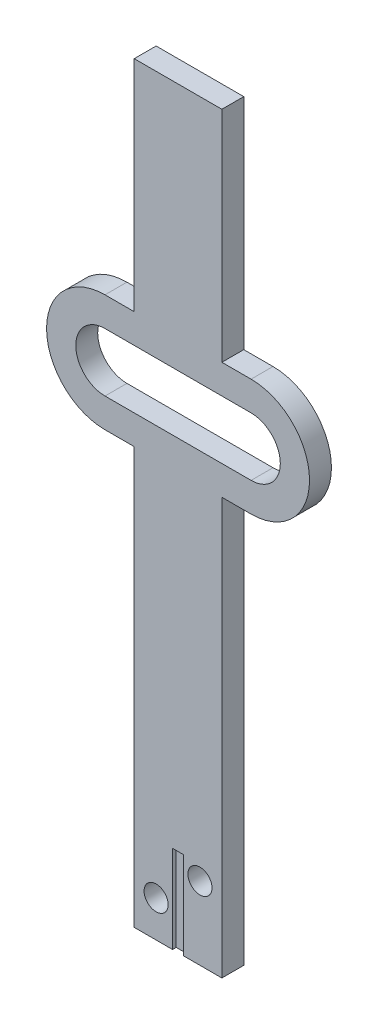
ISO-10303-21;
HEADER;
FILE_DESCRIPTION(('STEP AP214'),'2;1');
FILE_NAME('part.step','',(''),(''),'','','');
FILE_SCHEMA(('AUTOMOTIVE_DESIGN { 1 0 10303 214 1 1 1 1 }'));
ENDSEC;
DATA;
#1=APPLICATION_CONTEXT('core data for automotive mechanical design processes');
#2=APPLICATION_PROTOCOL_DEFINITION('international standard','automotive_design',2000,#1);
#3=PRODUCT_CONTEXT('',#1,'mechanical');
#4=PRODUCT('Part','Part','',(#3));
#5=PRODUCT_RELATED_PRODUCT_CATEGORY('part','',(#4));
#6=PRODUCT_DEFINITION_FORMATION('','',#4);
#7=PRODUCT_DEFINITION_CONTEXT('part definition',#1,'design');
#8=PRODUCT_DEFINITION('design','',#6,#7);
#9=PRODUCT_DEFINITION_SHAPE('','',#8);
#10=(LENGTH_UNIT() NAMED_UNIT(*) SI_UNIT(.MILLI.,.METRE.));
#11=(NAMED_UNIT(*) PLANE_ANGLE_UNIT() SI_UNIT($,.RADIAN.));
#12=(NAMED_UNIT(*) SI_UNIT($,.STERADIAN.) SOLID_ANGLE_UNIT());
#13=UNCERTAINTY_MEASURE_WITH_UNIT(LENGTH_MEASURE(1.E-05),#10,'distance_accuracy_value','');
#14=(GEOMETRIC_REPRESENTATION_CONTEXT(3) GLOBAL_UNCERTAINTY_ASSIGNED_CONTEXT((#13)) GLOBAL_UNIT_ASSIGNED_CONTEXT((#10,
#11,#12)) REPRESENTATION_CONTEXT('',''));
#15=CARTESIAN_POINT('',(0.,0.,0.));
#16=DIRECTION('',(0.,0.,1.));
#17=DIRECTION('',(1.,0.,0.));
#18=AXIS2_PLACEMENT_3D('',#15,#16,#17);
#19=CARTESIAN_POINT('',(-10.,0.,3.));
#20=DIRECTION('',(0.,0.,1.));
#21=DIRECTION('',(1.,0.,0.));
#22=AXIS2_PLACEMENT_3D('',#19,#20,#21);
#23=PLANE('',#22);
#24=CARTESIAN_POINT('',(-3.00000000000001,-60.,3.));
#25=DIRECTION('',(0.,0.,1.));
#26=DIRECTION('',(1.,0.,0.));
#27=AXIS2_PLACEMENT_3D('',#24,#25,#26);
#28=CIRCLE('',#27,1.64999999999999);
#29=CARTESIAN_POINT('',(-1.35000000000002,-60.,3.));
#30=VERTEX_POINT('',#29);
#31=EDGE_CURVE('E587',#30,#30,#28,.T.);
#32=ORIENTED_EDGE('',*,*,#31,.F.);
#33=EDGE_LOOP('',(#32));
#34=FACE_BOUND('',#33,.T.);
#35=CARTESIAN_POINT('',(3.00000000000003,-55.,3.));
#36=DIRECTION('',(0.,0.,1.));
#37=DIRECTION('',(1.,0.,0.));
#38=AXIS2_PLACEMENT_3D('',#35,#36,#37);
#39=CIRCLE('',#38,1.64999999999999);
#40=CARTESIAN_POINT('',(4.65000000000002,-55.,3.));
#41=VERTEX_POINT('',#40);
#42=EDGE_CURVE('E589',#41,#41,#39,.T.);
#43=ORIENTED_EDGE('',*,*,#42,.F.);
#44=EDGE_LOOP('',(#43));
#45=FACE_BOUND('',#44,.T.);
#46=DIRECTION('',(0.,-1.,0.));
#47=VECTOR('',#46,1.);
#48=CARTESIAN_POINT('',(-0.749999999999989,-53.,3.));
#49=LINE('',#48,#47);
#50=CARTESIAN_POINT('',(-0.749999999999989,-53.,3.));
#51=VERTEX_POINT('',#50);
#52=CARTESIAN_POINT('',(-0.749999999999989,-65.,3.));
#53=VERTEX_POINT('',#52);
#54=EDGE_CURVE('E171',#51,#53,#49,.T.);
#55=ORIENTED_EDGE('',*,*,#54,.F.);
#56=DIRECTION('',(-1.,0.,0.));
#57=VECTOR('',#56,1.);
#58=CARTESIAN_POINT('',(-0.749999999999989,-53.,3.));
#59=LINE('',#58,#57);
#60=CARTESIAN_POINT('',(0.750000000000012,-53.,3.));
#61=VERTEX_POINT('',#60);
#62=EDGE_CURVE('E597',#61,#51,#59,.T.);
#63=ORIENTED_EDGE('',*,*,#62,.F.);
#64=DIRECTION('',(0.,1.,0.));
#65=VECTOR('',#64,1.);
#66=CARTESIAN_POINT('',(0.750000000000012,-53.,3.));
#67=LINE('',#66,#65);
#68=CARTESIAN_POINT('',(0.750000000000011,-65.,3.));
#69=VERTEX_POINT('',#68);
#70=EDGE_CURVE('E181',#69,#61,#67,.T.);
#71=ORIENTED_EDGE('',*,*,#70,.F.);
#72=DIRECTION('',(1.,0.,0.));
#73=VECTOR('',#72,1.);
#74=CARTESIAN_POINT('',(-6.00000000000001,-65.,3.));
#75=LINE('',#74,#73);
#76=CARTESIAN_POINT('',(6.00000000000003,-65.,3.));
#77=VERTEX_POINT('',#76);
#78=EDGE_CURVE('E199',#69,#77,#75,.T.);
#79=ORIENTED_EDGE('',*,*,#78,.T.);
#80=DIRECTION('',(0.,1.,0.));
#81=VECTOR('',#80,1.);
#82=CARTESIAN_POINT('',(6.00000000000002,-7.99999999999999,3.));
#83=LINE('',#82,#81);
#84=CARTESIAN_POINT('',(6.00000000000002,-7.99999999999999,3.));
#85=VERTEX_POINT('',#84);
#86=EDGE_CURVE('E198',#77,#85,#83,.T.);
#87=ORIENTED_EDGE('',*,*,#86,.T.);
#88=DIRECTION('',(1.,0.,0.));
#89=VECTOR('',#88,1.);
#90=CARTESIAN_POINT('',(6.00000000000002,-7.99999999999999,3.));
#91=LINE('',#90,#89);
#92=CARTESIAN_POINT('',(10.,-8.00000000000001,3.));
#93=VERTEX_POINT('',#92);
#94=EDGE_CURVE('E201',#85,#93,#91,.T.);
#95=ORIENTED_EDGE('',*,*,#94,.T.);
#96=CARTESIAN_POINT('',(10.,0.,3.));
#97=DIRECTION('',(0.,0.,1.));
#98=DIRECTION('',(1.,0.,0.));
#99=AXIS2_PLACEMENT_3D('',#96,#97,#98);
#100=CIRCLE('',#99,8.);
#101=CARTESIAN_POINT('',(10.,8.,3.));
#102=VERTEX_POINT('',#101);
#103=EDGE_CURVE('E207',#93,#102,#100,.T.);
#104=ORIENTED_EDGE('',*,*,#103,.T.);
#105=DIRECTION('',(-1.,0.,0.));
#106=VECTOR('',#105,1.);
#107=CARTESIAN_POINT('',(5.99999999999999,8.,3.));
#108=LINE('',#107,#106);
#109=CARTESIAN_POINT('',(5.99999999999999,8.,3.));
#110=VERTEX_POINT('',#109);
#111=EDGE_CURVE('E209',#102,#110,#108,.T.);
#112=ORIENTED_EDGE('',*,*,#111,.T.);
#113=DIRECTION('',(0.,1.,0.));
#114=VECTOR('',#113,1.);
#115=CARTESIAN_POINT('',(5.99999999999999,38.,3.));
#116=LINE('',#115,#114);
#117=CARTESIAN_POINT('',(5.99999999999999,38.,3.));
#118=VERTEX_POINT('',#117);
#119=EDGE_CURVE('E211',#110,#118,#116,.T.);
#120=ORIENTED_EDGE('',*,*,#119,.T.);
#121=DIRECTION('',(-1.,0.,0.));
#122=VECTOR('',#121,1.);
#123=CARTESIAN_POINT('',(-6.00000000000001,38.,3.));
#124=LINE('',#123,#122);
#125=CARTESIAN_POINT('',(-6.00000000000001,38.,3.));
#126=VERTEX_POINT('',#125);
#127=EDGE_CURVE('E213',#118,#126,#124,.T.);
#128=ORIENTED_EDGE('',*,*,#127,.T.);
#129=DIRECTION('',(0.,-1.,0.));
#130=VECTOR('',#129,1.);
#131=CARTESIAN_POINT('',(-6.00000000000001,38.,3.));
#132=LINE('',#131,#130);
#133=CARTESIAN_POINT('',(-5.99999999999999,8.,3.));
#134=VERTEX_POINT('',#133);
#135=EDGE_CURVE('E283',#126,#134,#132,.T.);
#136=ORIENTED_EDGE('',*,*,#135,.T.);
#137=DIRECTION('',(-1.,0.,0.));
#138=VECTOR('',#137,1.);
#139=CARTESIAN_POINT('',(-10.,8.,3.));
#140=LINE('',#139,#138);
#141=CARTESIAN_POINT('',(-10.,8.,3.));
#142=VERTEX_POINT('',#141);
#143=EDGE_CURVE('E286',#134,#142,#140,.T.);
#144=ORIENTED_EDGE('',*,*,#143,.T.);
#145=CARTESIAN_POINT('',(-10.,0.,3.));
#146=DIRECTION('',(0.,0.,1.));
#147=DIRECTION('',(1.,0.,0.));
#148=AXIS2_PLACEMENT_3D('',#145,#146,#147);
#149=CIRCLE('',#148,8.);
#150=CARTESIAN_POINT('',(-10.,-8.00000000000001,3.));
#151=VERTEX_POINT('',#150);
#152=EDGE_CURVE('E251',#142,#151,#149,.T.);
#153=ORIENTED_EDGE('',*,*,#152,.T.);
#154=DIRECTION('',(1.,0.,0.));
#155=VECTOR('',#154,1.);
#156=CARTESIAN_POINT('',(-10.,-8.00000000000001,3.));
#157=LINE('',#156,#155);
#158=CARTESIAN_POINT('',(-6.00000000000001,-7.99999999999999,3.));
#159=VERTEX_POINT('',#158);
#160=EDGE_CURVE('E288',#151,#159,#157,.T.);
#161=ORIENTED_EDGE('',*,*,#160,.T.);
#162=DIRECTION('',(0.,-1.,0.));
#163=VECTOR('',#162,1.);
#164=CARTESIAN_POINT('',(-6.00000000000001,-7.99999999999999,3.));
#165=LINE('',#164,#163);
#166=CARTESIAN_POINT('',(-6.00000000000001,-65.,3.));
#167=VERTEX_POINT('',#166);
#168=EDGE_CURVE('E196',#159,#167,#165,.T.);
#169=ORIENTED_EDGE('',*,*,#168,.T.);
#170=EDGE_CURVE('E188',#167,#53,#75,.T.);
#171=ORIENTED_EDGE('',*,*,#170,.T.);
#172=EDGE_LOOP('',(#55,#63,#71,#79,#87,#95,#104,#112,#120,#128,#136,#144,#153,#161,#169,#171));
#173=FACE_BOUND('',#172,.T.);
#174=DIRECTION('',(1.,0.,0.));
#175=VECTOR('',#174,1.);
#176=CARTESIAN_POINT('',(10.,-4.00000000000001,3.));
#177=LINE('',#176,#175);
#178=CARTESIAN_POINT('',(-10.,-4.,3.));
#179=VERTEX_POINT('',#178);
#180=CARTESIAN_POINT('',(10.,-4.00000000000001,3.));
#181=VERTEX_POINT('',#180);
#182=EDGE_CURVE('E333',#179,#181,#177,.T.);
#183=ORIENTED_EDGE('',*,*,#182,.F.);
#184=CARTESIAN_POINT('',(-10.,0.,3.));
#185=DIRECTION('',(0.,0.,1.));
#186=DIRECTION('',(1.,0.,0.));
#187=AXIS2_PLACEMENT_3D('',#184,#185,#186);
#188=CIRCLE('',#187,4.);
#189=CARTESIAN_POINT('',(-10.,4.,3.));
#190=VERTEX_POINT('',#189);
#191=EDGE_CURVE('E331',#190,#179,#188,.T.);
#192=ORIENTED_EDGE('',*,*,#191,.F.);
#193=DIRECTION('',(-1.,0.,0.));
#194=VECTOR('',#193,1.);
#195=CARTESIAN_POINT('',(-10.,4.,3.));
#196=LINE('',#195,#194);
#197=CARTESIAN_POINT('',(10.,4.,3.));
#198=VERTEX_POINT('',#197);
#199=EDGE_CURVE('E337',#198,#190,#196,.T.);
#200=ORIENTED_EDGE('',*,*,#199,.F.);
#201=CARTESIAN_POINT('',(10.,0.,3.));
#202=DIRECTION('',(0.,0.,1.));
#203=DIRECTION('',(1.,0.,0.));
#204=AXIS2_PLACEMENT_3D('',#201,#202,#203);
#205=CIRCLE('',#204,4.);
#206=EDGE_CURVE('E335',#181,#198,#205,.T.);
#207=ORIENTED_EDGE('',*,*,#206,.F.);
#208=EDGE_LOOP('',(#183,#192,#200,#207));
#209=FACE_BOUND('',#208,.T.);
#210=ADVANCED_FACE('F33',(#34,#45,#173,#209),#23,.T.);
#211=CARTESIAN_POINT('',(-10.,0.,0.));
#212=DIRECTION('',(0.,0.,1.));
#213=DIRECTION('',(1.,0.,0.));
#214=AXIS2_PLACEMENT_3D('',#211,#212,#213);
#215=PLANE('',#214);
#216=CARTESIAN_POINT('',(-3.00000000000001,-60.,1.40972303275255E-11));
#217=DIRECTION('',(0.,0.,1.));
#218=DIRECTION('',(1.,0.,0.));
#219=AXIS2_PLACEMENT_3D('',#216,#217,#218);
#220=CIRCLE('',#219,1.65);
#221=CARTESIAN_POINT('',(-1.35000000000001,-60.,1.40972303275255E-11));
#222=VERTEX_POINT('',#221);
#223=EDGE_CURVE('E585',#222,#222,#220,.T.);
#224=ORIENTED_EDGE('',*,*,#223,.T.);
#225=EDGE_LOOP('',(#224));
#226=FACE_BOUND('',#225,.T.);
#227=CARTESIAN_POINT('',(3.00000000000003,-55.,7.09406491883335E-11));
#228=DIRECTION('',(0.,0.,1.));
#229=DIRECTION('',(1.,0.,0.));
#230=AXIS2_PLACEMENT_3D('',#227,#228,#229);
#231=CIRCLE('',#230,1.65);
#232=CARTESIAN_POINT('',(4.65000000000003,-55.,7.09406491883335E-11));
#233=VERTEX_POINT('',#232);
#234=EDGE_CURVE('E182',#233,#233,#231,.T.);
#235=ORIENTED_EDGE('',*,*,#234,.T.);
#236=EDGE_LOOP('',(#235));
#237=FACE_BOUND('',#236,.T.);
#238=DIRECTION('',(0.,-1.,0.));
#239=VECTOR('',#238,1.);
#240=CARTESIAN_POINT('',(-6.00000000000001,38.,0.));
#241=LINE('',#240,#239);
#242=CARTESIAN_POINT('',(-6.00000000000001,38.,0.));
#243=VERTEX_POINT('',#242);
#244=CARTESIAN_POINT('',(-5.99999999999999,8.,0.));
#245=VERTEX_POINT('',#244);
#246=EDGE_CURVE('E264',#243,#245,#241,.T.);
#247=ORIENTED_EDGE('',*,*,#246,.F.);
#248=DIRECTION('',(-1.,0.,0.));
#249=VECTOR('',#248,1.);
#250=CARTESIAN_POINT('',(-6.00000000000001,38.,0.));
#251=LINE('',#250,#249);
#252=CARTESIAN_POINT('',(5.99999999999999,38.,0.));
#253=VERTEX_POINT('',#252);
#254=EDGE_CURVE('E281',#253,#243,#251,.T.);
#255=ORIENTED_EDGE('',*,*,#254,.F.);
#256=DIRECTION('',(0.,1.,0.));
#257=VECTOR('',#256,1.);
#258=CARTESIAN_POINT('',(5.99999999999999,38.,0.));
#259=LINE('',#258,#257);
#260=CARTESIAN_POINT('',(5.99999999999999,8.,0.));
#261=VERTEX_POINT('',#260);
#262=EDGE_CURVE('E279',#261,#253,#259,.T.);
#263=ORIENTED_EDGE('',*,*,#262,.F.);
#264=DIRECTION('',(-1.,0.,0.));
#265=VECTOR('',#264,1.);
#266=CARTESIAN_POINT('',(5.99999999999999,8.,0.));
#267=LINE('',#266,#265);
#268=CARTESIAN_POINT('',(10.,8.,0.));
#269=VERTEX_POINT('',#268);
#270=EDGE_CURVE('E277',#269,#261,#267,.T.);
#271=ORIENTED_EDGE('',*,*,#270,.F.);
#272=CARTESIAN_POINT('',(10.,0.,0.));
#273=DIRECTION('',(0.,0.,1.));
#274=DIRECTION('',(1.,0.,0.));
#275=AXIS2_PLACEMENT_3D('',#272,#273,#274);
#276=CIRCLE('',#275,8.);
#277=CARTESIAN_POINT('',(10.,-8.00000000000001,0.));
#278=VERTEX_POINT('',#277);
#279=EDGE_CURVE('E275',#278,#269,#276,.T.);
#280=ORIENTED_EDGE('',*,*,#279,.F.);
#281=DIRECTION('',(1.,0.,0.));
#282=VECTOR('',#281,1.);
#283=CARTESIAN_POINT('',(6.00000000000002,-7.99999999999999,0.));
#284=LINE('',#283,#282);
#285=CARTESIAN_POINT('',(6.00000000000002,-7.99999999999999,0.));
#286=VERTEX_POINT('',#285);
#287=EDGE_CURVE('E273',#286,#278,#284,.T.);
#288=ORIENTED_EDGE('',*,*,#287,.F.);
#289=DIRECTION('',(0.,1.,0.));
#290=VECTOR('',#289,1.);
#291=CARTESIAN_POINT('',(6.00000000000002,-7.99999999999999,0.));
#292=LINE('',#291,#290);
#293=CARTESIAN_POINT('',(6.00000000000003,-65.,0.));
#294=VERTEX_POINT('',#293);
#295=EDGE_CURVE('E271',#294,#286,#292,.T.);
#296=ORIENTED_EDGE('',*,*,#295,.F.);
#297=DIRECTION('',(1.,0.,0.));
#298=VECTOR('',#297,1.);
#299=CARTESIAN_POINT('',(-6.00000000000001,-65.,0.));
#300=LINE('',#299,#298);
#301=CARTESIAN_POINT('',(-6.00000000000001,-65.,0.));
#302=VERTEX_POINT('',#301);
#303=EDGE_CURVE('E269',#302,#294,#300,.T.);
#304=ORIENTED_EDGE('',*,*,#303,.F.);
#305=DIRECTION('',(0.,-1.,0.));
#306=VECTOR('',#305,1.);
#307=CARTESIAN_POINT('',(-6.00000000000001,-7.99999999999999,0.));
#308=LINE('',#307,#306);
#309=CARTESIAN_POINT('',(-6.00000000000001,-7.99999999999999,0.));
#310=VERTEX_POINT('',#309);
#311=EDGE_CURVE('E262',#310,#302,#308,.T.);
#312=ORIENTED_EDGE('',*,*,#311,.F.);
#313=DIRECTION('',(1.,0.,0.));
#314=VECTOR('',#313,1.);
#315=CARTESIAN_POINT('',(-10.,-8.00000000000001,0.));
#316=LINE('',#315,#314);
#317=CARTESIAN_POINT('',(-10.,-8.00000000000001,0.));
#318=VERTEX_POINT('',#317);
#319=EDGE_CURVE('E260',#318,#310,#316,.T.);
#320=ORIENTED_EDGE('',*,*,#319,.F.);
#321=CARTESIAN_POINT('',(-10.,0.,0.));
#322=DIRECTION('',(0.,0.,1.));
#323=DIRECTION('',(1.,0.,0.));
#324=AXIS2_PLACEMENT_3D('',#321,#322,#323);
#325=CIRCLE('',#324,8.);
#326=CARTESIAN_POINT('',(-10.,8.,0.));
#327=VERTEX_POINT('',#326);
#328=EDGE_CURVE('E250',#327,#318,#325,.T.);
#329=ORIENTED_EDGE('',*,*,#328,.F.);
#330=DIRECTION('',(-1.,0.,0.));
#331=VECTOR('',#330,1.);
#332=CARTESIAN_POINT('',(-10.,8.,0.));
#333=LINE('',#332,#331);
#334=EDGE_CURVE('E258',#245,#327,#333,.T.);
#335=ORIENTED_EDGE('',*,*,#334,.F.);
#336=EDGE_LOOP('',(#247,#255,#263,#271,#280,#288,#296,#304,#312,#320,#329,#335));
#337=FACE_BOUND('',#336,.T.);
#338=CARTESIAN_POINT('',(-10.,0.,0.));
#339=DIRECTION('',(0.,0.,1.));
#340=DIRECTION('',(1.,0.,0.));
#341=AXIS2_PLACEMENT_3D('',#338,#339,#340);
#342=CIRCLE('',#341,4.);
#343=CARTESIAN_POINT('',(-10.,4.,0.));
#344=VERTEX_POINT('',#343);
#345=CARTESIAN_POINT('',(-10.,-4.,0.));
#346=VERTEX_POINT('',#345);
#347=EDGE_CURVE('E319',#344,#346,#342,.T.);
#348=ORIENTED_EDGE('',*,*,#347,.T.);
#349=DIRECTION('',(1.,0.,0.));
#350=VECTOR('',#349,1.);
#351=CARTESIAN_POINT('',(10.,-4.00000000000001,0.));
#352=LINE('',#351,#350);
#353=CARTESIAN_POINT('',(10.,-4.00000000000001,0.));
#354=VERTEX_POINT('',#353);
#355=EDGE_CURVE('E322',#346,#354,#352,.T.);
#356=ORIENTED_EDGE('',*,*,#355,.T.);
#357=CARTESIAN_POINT('',(10.,0.,0.));
#358=DIRECTION('',(0.,0.,1.));
#359=DIRECTION('',(1.,0.,0.));
#360=AXIS2_PLACEMENT_3D('',#357,#358,#359);
#361=CIRCLE('',#360,4.);
#362=CARTESIAN_POINT('',(10.,4.,0.));
#363=VERTEX_POINT('',#362);
#364=EDGE_CURVE('E325',#354,#363,#361,.T.);
#365=ORIENTED_EDGE('',*,*,#364,.T.);
#366=DIRECTION('',(-1.,0.,0.));
#367=VECTOR('',#366,1.);
#368=CARTESIAN_POINT('',(-10.,4.,0.));
#369=LINE('',#368,#367);
#370=EDGE_CURVE('E328',#363,#344,#369,.T.);
#371=ORIENTED_EDGE('',*,*,#370,.T.);
#372=EDGE_LOOP('',(#348,#356,#365,#371));
#373=FACE_BOUND('',#372,.T.);
#374=ADVANCED_FACE('F256',(#226,#237,#337,#373),#215,.F.);
#375=CARTESIAN_POINT('',(-6.00000000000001,38.,3.));
#376=DIRECTION('',(1.,0.,0.));
#377=DIRECTION('',(0.,1.,0.));
#378=AXIS2_PLACEMENT_3D('',#375,#376,#377);
#379=PLANE('',#378);
#380=ORIENTED_EDGE('',*,*,#246,.T.);
#381=DIRECTION('',(0.,0.,-1.));
#382=VECTOR('',#381,1.);
#383=CARTESIAN_POINT('',(-5.99999999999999,8.,3.));
#384=LINE('',#383,#382);
#385=EDGE_CURVE('E11',#134,#245,#384,.T.);
#386=ORIENTED_EDGE('',*,*,#385,.F.);
#387=ORIENTED_EDGE('',*,*,#135,.F.);
#388=DIRECTION('',(0.,0.,-1.));
#389=VECTOR('',#388,1.);
#390=CARTESIAN_POINT('',(-6.00000000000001,38.,3.));
#391=LINE('',#390,#389);
#392=EDGE_CURVE('E215',#126,#243,#391,.T.);
#393=ORIENTED_EDGE('',*,*,#392,.T.);
#394=EDGE_LOOP('',(#380,#386,#387,#393));
#395=FACE_BOUND('',#394,.T.);
#396=ADVANCED_FACE('F35',(#395),#379,.F.);
#397=CARTESIAN_POINT('',(-10.,8.,3.));
#398=DIRECTION('',(0.,-1.,0.));
#399=DIRECTION('',(0.,0.,-1.));
#400=AXIS2_PLACEMENT_3D('',#397,#398,#399);
#401=PLANE('',#400);
#402=ORIENTED_EDGE('',*,*,#334,.T.);
#403=DIRECTION('',(0.,0.,-1.));
#404=VECTOR('',#403,1.);
#405=CARTESIAN_POINT('',(-10.,8.,3.));
#406=LINE('',#405,#404);
#407=EDGE_CURVE('E41',#142,#327,#406,.T.);
#408=ORIENTED_EDGE('',*,*,#407,.F.);
#409=ORIENTED_EDGE('',*,*,#143,.F.);
#410=ORIENTED_EDGE('',*,*,#385,.T.);
#411=EDGE_LOOP('',(#402,#408,#409,#410));
#412=FACE_BOUND('',#411,.T.);
#413=ADVANCED_FACE('F518',(#412),#401,.F.);
#414=CARTESIAN_POINT('',(-10.,0.,3.));
#415=DIRECTION('',(0.,0.,-1.));
#416=DIRECTION('',(-1.,0.,0.));
#417=AXIS2_PLACEMENT_3D('',#414,#415,#416);
#418=CYLINDRICAL_SURFACE('',#417,8.);
#419=ORIENTED_EDGE('',*,*,#328,.T.);
#420=DIRECTION('',(0.,0.,-1.));
#421=VECTOR('',#420,1.);
#422=CARTESIAN_POINT('',(-10.,-8.00000000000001,3.));
#423=LINE('',#422,#421);
#424=EDGE_CURVE('E241',#151,#318,#423,.T.);
#425=ORIENTED_EDGE('',*,*,#424,.F.);
#426=ORIENTED_EDGE('',*,*,#152,.F.);
#427=ORIENTED_EDGE('',*,*,#407,.T.);
#428=EDGE_LOOP('',(#419,#425,#426,#427));
#429=FACE_BOUND('',#428,.T.);
#430=ADVANCED_FACE('F248',(#429),#418,.T.);
#431=CARTESIAN_POINT('',(-10.,-8.00000000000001,3.));
#432=DIRECTION('',(0.,1.,0.));
#433=DIRECTION('',(-1.,0.,0.));
#434=AXIS2_PLACEMENT_3D('',#431,#432,#433);
#435=PLANE('',#434);
#436=ORIENTED_EDGE('',*,*,#319,.T.);
#437=DIRECTION('',(0.,0.,-1.));
#438=VECTOR('',#437,1.);
#439=CARTESIAN_POINT('',(-6.00000000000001,-7.99999999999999,3.));
#440=LINE('',#439,#438);
#441=EDGE_CURVE('E238',#159,#310,#440,.T.);
#442=ORIENTED_EDGE('',*,*,#441,.F.);
#443=ORIENTED_EDGE('',*,*,#160,.F.);
#444=ORIENTED_EDGE('',*,*,#424,.T.);
#445=EDGE_LOOP('',(#436,#442,#443,#444));
#446=FACE_BOUND('',#445,.T.);
#447=ADVANCED_FACE('F292',(#446),#435,.F.);
#448=CARTESIAN_POINT('',(-6.00000000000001,-7.99999999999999,3.));
#449=DIRECTION('',(1.,0.,0.));
#450=DIRECTION('',(0.,1.,0.));
#451=AXIS2_PLACEMENT_3D('',#448,#449,#450);
#452=PLANE('',#451);
#453=ORIENTED_EDGE('',*,*,#311,.T.);
#454=DIRECTION('',(0.,0.,-1.));
#455=VECTOR('',#454,1.);
#456=CARTESIAN_POINT('',(-6.00000000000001,-65.,3.));
#457=LINE('',#456,#455);
#458=EDGE_CURVE('E236',#167,#302,#457,.T.);
#459=ORIENTED_EDGE('',*,*,#458,.F.);
#460=ORIENTED_EDGE('',*,*,#168,.F.);
#461=ORIENTED_EDGE('',*,*,#441,.T.);
#462=EDGE_LOOP('',(#453,#459,#460,#461));
#463=FACE_BOUND('',#462,.T.);
#464=ADVANCED_FACE('F294',(#463),#452,.F.);
#465=CARTESIAN_POINT('',(-6.00000000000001,-65.,3.));
#466=DIRECTION('',(0.,1.,0.));
#467=DIRECTION('',(0.,0.,1.));
#468=AXIS2_PLACEMENT_3D('',#465,#466,#467);
#469=PLANE('',#468);
#470=DIRECTION('',(1.,0.,0.));
#471=VECTOR('',#470,1.);
#472=CARTESIAN_POINT('',(-0.749999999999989,-65.,2.5));
#473=LINE('',#472,#471);
#474=CARTESIAN_POINT('',(-0.749999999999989,-65.,2.5));
#475=VERTEX_POINT('',#474);
#476=CARTESIAN_POINT('',(0.750000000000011,-65.,2.5));
#477=VERTEX_POINT('',#476);
#478=EDGE_CURVE('E190',#475,#477,#473,.T.);
#479=ORIENTED_EDGE('',*,*,#478,.F.);
#480=DIRECTION('',(0.,0.,1.));
#481=VECTOR('',#480,1.);
#482=CARTESIAN_POINT('',(-0.749999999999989,-65.,2.5));
#483=LINE('',#482,#481);
#484=EDGE_CURVE('E174',#475,#53,#483,.T.);
#485=ORIENTED_EDGE('',*,*,#484,.T.);
#486=ORIENTED_EDGE('',*,*,#170,.F.);
#487=ORIENTED_EDGE('',*,*,#458,.T.);
#488=ORIENTED_EDGE('',*,*,#303,.T.);
#489=DIRECTION('',(0.,0.,-1.));
#490=VECTOR('',#489,1.);
#491=CARTESIAN_POINT('',(6.00000000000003,-65.,3.));
#492=LINE('',#491,#490);
#493=EDGE_CURVE('E233',#77,#294,#492,.T.);
#494=ORIENTED_EDGE('',*,*,#493,.F.);
#495=ORIENTED_EDGE('',*,*,#78,.F.);
#496=DIRECTION('',(0.,0.,1.));
#497=VECTOR('',#496,1.);
#498=CARTESIAN_POINT('',(0.750000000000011,-65.,2.5));
#499=LINE('',#498,#497);
#500=EDGE_CURVE('E191',#477,#69,#499,.T.);
#501=ORIENTED_EDGE('',*,*,#500,.F.);
#502=EDGE_LOOP('',(#479,#485,#486,#487,#488,#494,#495,#501));
#503=FACE_BOUND('',#502,.T.);
#504=ADVANCED_FACE('F186',(#503),#469,.F.);
#505=CARTESIAN_POINT('',(6.00000000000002,-7.99999999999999,3.));
#506=DIRECTION('',(-1.,0.,0.));
#507=DIRECTION('',(0.,-1.,0.));
#508=AXIS2_PLACEMENT_3D('',#505,#506,#507);
#509=PLANE('',#508);
#510=ORIENTED_EDGE('',*,*,#295,.T.);
#511=DIRECTION('',(0.,0.,-1.));
#512=VECTOR('',#511,1.);
#513=CARTESIAN_POINT('',(6.00000000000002,-7.99999999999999,3.));
#514=LINE('',#513,#512);
#515=EDGE_CURVE('E230',#85,#286,#514,.T.);
#516=ORIENTED_EDGE('',*,*,#515,.F.);
#517=ORIENTED_EDGE('',*,*,#86,.F.);
#518=ORIENTED_EDGE('',*,*,#493,.T.);
#519=EDGE_LOOP('',(#510,#516,#517,#518));
#520=FACE_BOUND('',#519,.T.);
#521=ADVANCED_FACE('F302',(#520),#509,.F.);
#522=CARTESIAN_POINT('',(6.00000000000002,-7.99999999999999,3.));
#523=DIRECTION('',(0.,1.,0.));
#524=DIRECTION('',(-1.,0.,0.));
#525=AXIS2_PLACEMENT_3D('',#522,#523,#524);
#526=PLANE('',#525);
#527=ORIENTED_EDGE('',*,*,#287,.T.);
#528=DIRECTION('',(0.,0.,-1.));
#529=VECTOR('',#528,1.);
#530=CARTESIAN_POINT('',(10.,-8.00000000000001,3.));
#531=LINE('',#530,#529);
#532=EDGE_CURVE('E227',#93,#278,#531,.T.);
#533=ORIENTED_EDGE('',*,*,#532,.F.);
#534=ORIENTED_EDGE('',*,*,#94,.F.);
#535=ORIENTED_EDGE('',*,*,#515,.T.);
#536=EDGE_LOOP('',(#527,#533,#534,#535));
#537=FACE_BOUND('',#536,.T.);
#538=ADVANCED_FACE('F306',(#537),#526,.F.);
#539=CARTESIAN_POINT('',(10.,0.,3.));
#540=DIRECTION('',(0.,0.,-1.));
#541=DIRECTION('',(-1.,0.,0.));
#542=AXIS2_PLACEMENT_3D('',#539,#540,#541);
#543=CYLINDRICAL_SURFACE('',#542,8.);
#544=ORIENTED_EDGE('',*,*,#279,.T.);
#545=DIRECTION('',(0.,0.,-1.));
#546=VECTOR('',#545,1.);
#547=CARTESIAN_POINT('',(10.,8.,3.));
#548=LINE('',#547,#546);
#549=EDGE_CURVE('E224',#102,#269,#548,.T.);
#550=ORIENTED_EDGE('',*,*,#549,.F.);
#551=ORIENTED_EDGE('',*,*,#103,.F.);
#552=ORIENTED_EDGE('',*,*,#532,.T.);
#553=EDGE_LOOP('',(#544,#550,#551,#552));
#554=FACE_BOUND('',#553,.T.);
#555=ADVANCED_FACE('F367',(#554),#543,.T.);
#556=CARTESIAN_POINT('',(5.99999999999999,8.,3.));
#557=DIRECTION('',(0.,-1.,0.));
#558=DIRECTION('',(1.,0.,0.));
#559=AXIS2_PLACEMENT_3D('',#556,#557,#558);
#560=PLANE('',#559);
#561=ORIENTED_EDGE('',*,*,#270,.T.);
#562=DIRECTION('',(0.,0.,-1.));
#563=VECTOR('',#562,1.);
#564=CARTESIAN_POINT('',(5.99999999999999,8.,3.));
#565=LINE('',#564,#563);
#566=EDGE_CURVE('E221',#110,#261,#565,.T.);
#567=ORIENTED_EDGE('',*,*,#566,.F.);
#568=ORIENTED_EDGE('',*,*,#111,.F.);
#569=ORIENTED_EDGE('',*,*,#549,.T.);
#570=EDGE_LOOP('',(#561,#567,#568,#569));
#571=FACE_BOUND('',#570,.T.);
#572=ADVANCED_FACE('F365',(#571),#560,.F.);
#573=CARTESIAN_POINT('',(5.99999999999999,38.,3.));
#574=DIRECTION('',(-1.,0.,0.));
#575=DIRECTION('',(0.,-1.,0.));
#576=AXIS2_PLACEMENT_3D('',#573,#574,#575);
#577=PLANE('',#576);
#578=ORIENTED_EDGE('',*,*,#262,.T.);
#579=DIRECTION('',(0.,0.,-1.));
#580=VECTOR('',#579,1.);
#581=CARTESIAN_POINT('',(5.99999999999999,38.,3.));
#582=LINE('',#581,#580);
#583=EDGE_CURVE('E218',#118,#253,#582,.T.);
#584=ORIENTED_EDGE('',*,*,#583,.F.);
#585=ORIENTED_EDGE('',*,*,#119,.F.);
#586=ORIENTED_EDGE('',*,*,#566,.T.);
#587=EDGE_LOOP('',(#578,#584,#585,#586));
#588=FACE_BOUND('',#587,.T.);
#589=ADVANCED_FACE('F361',(#588),#577,.F.);
#590=CARTESIAN_POINT('',(-6.00000000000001,38.,3.));
#591=DIRECTION('',(0.,-1.,0.));
#592=DIRECTION('',(1.,0.,0.));
#593=AXIS2_PLACEMENT_3D('',#590,#591,#592);
#594=PLANE('',#593);
#595=ORIENTED_EDGE('',*,*,#254,.T.);
#596=ORIENTED_EDGE('',*,*,#392,.F.);
#597=ORIENTED_EDGE('',*,*,#127,.F.);
#598=ORIENTED_EDGE('',*,*,#583,.T.);
#599=EDGE_LOOP('',(#595,#596,#597,#598));
#600=FACE_BOUND('',#599,.T.);
#601=ADVANCED_FACE('F356',(#600),#594,.F.);
#602=CARTESIAN_POINT('',(-10.,0.,3.));
#603=DIRECTION('',(0.,0.,-1.));
#604=DIRECTION('',(-1.,0.,0.));
#605=AXIS2_PLACEMENT_3D('',#602,#603,#604);
#606=CYLINDRICAL_SURFACE('',#605,4.);
#607=ORIENTED_EDGE('',*,*,#347,.F.);
#608=DIRECTION('',(0.,0.,-1.));
#609=VECTOR('',#608,1.);
#610=CARTESIAN_POINT('',(-10.,4.,3.));
#611=LINE('',#610,#609);
#612=EDGE_CURVE('E339',#190,#344,#611,.T.);
#613=ORIENTED_EDGE('',*,*,#612,.F.);
#614=ORIENTED_EDGE('',*,*,#191,.T.);
#615=DIRECTION('',(0.,0.,-1.));
#616=VECTOR('',#615,1.);
#617=CARTESIAN_POINT('',(-10.,-4.,3.));
#618=LINE('',#617,#616);
#619=EDGE_CURVE('E345',#179,#346,#618,.T.);
#620=ORIENTED_EDGE('',*,*,#619,.T.);
#621=EDGE_LOOP('',(#607,#613,#614,#620));
#622=FACE_BOUND('',#621,.T.);
#623=ADVANCED_FACE('F390',(#622),#606,.F.);
#624=CARTESIAN_POINT('',(10.,-4.00000000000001,3.));
#625=DIRECTION('',(0.,1.,0.));
#626=DIRECTION('',(-1.,0.,0.));
#627=AXIS2_PLACEMENT_3D('',#624,#625,#626);
#628=PLANE('',#627);
#629=ORIENTED_EDGE('',*,*,#355,.F.);
#630=ORIENTED_EDGE('',*,*,#619,.F.);
#631=ORIENTED_EDGE('',*,*,#182,.T.);
#632=DIRECTION('',(0.,0.,-1.));
#633=VECTOR('',#632,1.);
#634=CARTESIAN_POINT('',(10.,-4.00000000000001,3.));
#635=LINE('',#634,#633);
#636=EDGE_CURVE('E343',#181,#354,#635,.T.);
#637=ORIENTED_EDGE('',*,*,#636,.T.);
#638=EDGE_LOOP('',(#629,#630,#631,#637));
#639=FACE_BOUND('',#638,.T.);
#640=ADVANCED_FACE('F406',(#639),#628,.T.);
#641=CARTESIAN_POINT('',(10.,0.,3.));
#642=DIRECTION('',(0.,0.,-1.));
#643=DIRECTION('',(-1.,0.,0.));
#644=AXIS2_PLACEMENT_3D('',#641,#642,#643);
#645=CYLINDRICAL_SURFACE('',#644,4.);
#646=ORIENTED_EDGE('',*,*,#364,.F.);
#647=ORIENTED_EDGE('',*,*,#636,.F.);
#648=ORIENTED_EDGE('',*,*,#206,.T.);
#649=DIRECTION('',(0.,0.,-1.));
#650=VECTOR('',#649,1.);
#651=CARTESIAN_POINT('',(10.,4.,3.));
#652=LINE('',#651,#650);
#653=EDGE_CURVE('E56',#198,#363,#652,.T.);
#654=ORIENTED_EDGE('',*,*,#653,.T.);
#655=EDGE_LOOP('',(#646,#647,#648,#654));
#656=FACE_BOUND('',#655,.T.);
#657=ADVANCED_FACE('F413',(#656),#645,.F.);
#658=CARTESIAN_POINT('',(-10.,4.,3.));
#659=DIRECTION('',(0.,-1.,0.));
#660=DIRECTION('',(1.,0.,0.));
#661=AXIS2_PLACEMENT_3D('',#658,#659,#660);
#662=PLANE('',#661);
#663=ORIENTED_EDGE('',*,*,#370,.F.);
#664=ORIENTED_EDGE('',*,*,#653,.F.);
#665=ORIENTED_EDGE('',*,*,#199,.T.);
#666=ORIENTED_EDGE('',*,*,#612,.T.);
#667=EDGE_LOOP('',(#663,#664,#665,#666));
#668=FACE_BOUND('',#667,.T.);
#669=ADVANCED_FACE('F421',(#668),#662,.T.);
#670=CARTESIAN_POINT('',(-0.749999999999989,-53.,2.5));
#671=DIRECTION('',(-1.,0.,0.));
#672=DIRECTION('',(0.,0.,1.));
#673=AXIS2_PLACEMENT_3D('',#670,#671,#672);
#674=PLANE('',#673);
#675=ORIENTED_EDGE('',*,*,#54,.T.);
#676=ORIENTED_EDGE('',*,*,#484,.F.);
#677=DIRECTION('',(0.,-1.,0.));
#678=VECTOR('',#677,1.);
#679=CARTESIAN_POINT('',(-0.749999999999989,-53.,2.5));
#680=LINE('',#679,#678);
#681=CARTESIAN_POINT('',(-0.749999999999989,-53.,2.5));
#682=VERTEX_POINT('',#681);
#683=EDGE_CURVE('E48',#682,#475,#680,.T.);
#684=ORIENTED_EDGE('',*,*,#683,.F.);
#685=DIRECTION('',(0.,0.,1.));
#686=VECTOR('',#685,1.);
#687=CARTESIAN_POINT('',(-0.749999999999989,-53.,2.5));
#688=LINE('',#687,#686);
#689=EDGE_CURVE('E176',#682,#51,#688,.T.);
#690=ORIENTED_EDGE('',*,*,#689,.T.);
#691=EDGE_LOOP('',(#675,#676,#684,#690));
#692=FACE_BOUND('',#691,.T.);
#693=ADVANCED_FACE('F173',(#692),#674,.F.);
#694=CARTESIAN_POINT('',(-0.749999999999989,-53.,2.5));
#695=DIRECTION('',(0.,1.,0.));
#696=DIRECTION('',(0.,0.,1.));
#697=AXIS2_PLACEMENT_3D('',#694,#695,#696);
#698=PLANE('',#697);
#699=ORIENTED_EDGE('',*,*,#62,.T.);
#700=ORIENTED_EDGE('',*,*,#689,.F.);
#701=DIRECTION('',(-1.,0.,0.));
#702=VECTOR('',#701,1.);
#703=CARTESIAN_POINT('',(-0.749999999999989,-53.,2.5));
#704=LINE('',#703,#702);
#705=CARTESIAN_POINT('',(0.750000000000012,-53.,2.5));
#706=VERTEX_POINT('',#705);
#707=EDGE_CURVE('E192',#706,#682,#704,.T.);
#708=ORIENTED_EDGE('',*,*,#707,.F.);
#709=DIRECTION('',(0.,0.,1.));
#710=VECTOR('',#709,1.);
#711=CARTESIAN_POINT('',(0.750000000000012,-53.,2.5));
#712=LINE('',#711,#710);
#713=EDGE_CURVE('E314',#706,#61,#712,.T.);
#714=ORIENTED_EDGE('',*,*,#713,.T.);
#715=EDGE_LOOP('',(#699,#700,#708,#714));
#716=FACE_BOUND('',#715,.T.);
#717=ADVANCED_FACE('F435',(#716),#698,.F.);
#718=CARTESIAN_POINT('',(0.750000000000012,-53.,2.5));
#719=DIRECTION('',(1.,0.,0.));
#720=DIRECTION('',(0.,1.,0.));
#721=AXIS2_PLACEMENT_3D('',#718,#719,#720);
#722=PLANE('',#721);
#723=ORIENTED_EDGE('',*,*,#70,.T.);
#724=ORIENTED_EDGE('',*,*,#713,.F.);
#725=DIRECTION('',(0.,1.,0.));
#726=VECTOR('',#725,1.);
#727=CARTESIAN_POINT('',(0.750000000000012,-53.,2.5));
#728=LINE('',#727,#726);
#729=EDGE_CURVE('E601',#477,#706,#728,.T.);
#730=ORIENTED_EDGE('',*,*,#729,.F.);
#731=ORIENTED_EDGE('',*,*,#500,.T.);
#732=EDGE_LOOP('',(#723,#724,#730,#731));
#733=FACE_BOUND('',#732,.T.);
#734=ADVANCED_FACE('F442',(#733),#722,.F.);
#735=CARTESIAN_POINT('',(-0.749999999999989,-65.,2.5));
#736=DIRECTION('',(0.,0.,1.));
#737=DIRECTION('',(1.,0.,0.));
#738=AXIS2_PLACEMENT_3D('',#735,#736,#737);
#739=PLANE('',#738);
#740=ORIENTED_EDGE('',*,*,#683,.T.);
#741=ORIENTED_EDGE('',*,*,#478,.T.);
#742=ORIENTED_EDGE('',*,*,#729,.T.);
#743=ORIENTED_EDGE('',*,*,#707,.T.);
#744=EDGE_LOOP('',(#740,#741,#742,#743));
#745=FACE_BOUND('',#744,.T.);
#746=ADVANCED_FACE('F450',(#745),#739,.T.);
#747=CARTESIAN_POINT('',(3.00000000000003,-55.,3.));
#748=DIRECTION('',(0.,0.,1.));
#749=DIRECTION('',(1.,0.,0.));
#750=AXIS2_PLACEMENT_3D('',#747,#748,#749);
#751=CYLINDRICAL_SURFACE('',#750,1.64999999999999);
#752=ORIENTED_EDGE('',*,*,#234,.F.);
#753=EDGE_LOOP('',(#752));
#754=FACE_BOUND('',#753,.T.);
#755=ORIENTED_EDGE('',*,*,#42,.T.);
#756=EDGE_LOOP('',(#755));
#757=FACE_BOUND('',#756,.T.);
#758=ADVANCED_FACE('F457',(#754,#757),#751,.F.);
#759=CARTESIAN_POINT('',(-3.00000000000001,-60.,3.));
#760=DIRECTION('',(0.,0.,1.));
#761=DIRECTION('',(1.,0.,0.));
#762=AXIS2_PLACEMENT_3D('',#759,#760,#761);
#763=CYLINDRICAL_SURFACE('',#762,1.64999999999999);
#764=ORIENTED_EDGE('',*,*,#223,.F.);
#765=EDGE_LOOP('',(#764));
#766=FACE_BOUND('',#765,.T.);
#767=ORIENTED_EDGE('',*,*,#31,.T.);
#768=EDGE_LOOP('',(#767));
#769=FACE_BOUND('',#768,.T.);
#770=ADVANCED_FACE('F464',(#766,#769),#763,.F.);
#771=CLOSED_SHELL('',(#210,#374,#396,#413,#430,#447,#464,#504,#521,#538,#555,#572,#589,#601,
#623,#640,#657,#669,#693,#717,#734,#746,#758,#770));
#772=MANIFOLD_SOLID_BREP('B2',#771);
#773=ADVANCED_BREP_SHAPE_REPRESENTATION('',(#18,#772),#14);
#774=SHAPE_DEFINITION_REPRESENTATION(#9,#773);
ENDSEC;
END-ISO-10303-21;
